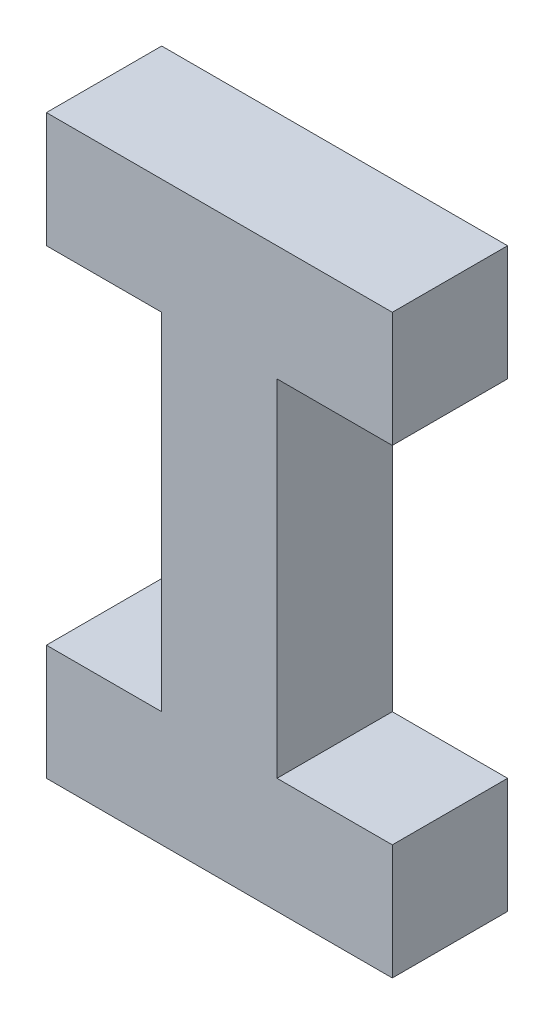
ISO-10303-21;
HEADER;
FILE_DESCRIPTION(('STEP AP214'),'2;1');
FILE_NAME('part.step','',(''),(''),'','','');
FILE_SCHEMA(('AUTOMOTIVE_DESIGN { 1 0 10303 214 1 1 1 1 }'));
ENDSEC;
DATA;
#1=APPLICATION_CONTEXT('core data for automotive mechanical design processes');
#2=APPLICATION_PROTOCOL_DEFINITION('international standard','automotive_design',2000,#1);
#3=PRODUCT_CONTEXT('',#1,'mechanical');
#4=PRODUCT('Part','Part','',(#3));
#5=PRODUCT_RELATED_PRODUCT_CATEGORY('part','',(#4));
#6=PRODUCT_DEFINITION_FORMATION('','',#4);
#7=PRODUCT_DEFINITION_CONTEXT('part definition',#1,'design');
#8=PRODUCT_DEFINITION('design','',#6,#7);
#9=PRODUCT_DEFINITION_SHAPE('','',#8);
#10=(LENGTH_UNIT() NAMED_UNIT(*) SI_UNIT(.MILLI.,.METRE.));
#11=(NAMED_UNIT(*) PLANE_ANGLE_UNIT() SI_UNIT($,.RADIAN.));
#12=(NAMED_UNIT(*) SI_UNIT($,.STERADIAN.) SOLID_ANGLE_UNIT());
#13=UNCERTAINTY_MEASURE_WITH_UNIT(LENGTH_MEASURE(1.E-05),#10,'distance_accuracy_value','');
#14=(GEOMETRIC_REPRESENTATION_CONTEXT(3) GLOBAL_UNCERTAINTY_ASSIGNED_CONTEXT((#13)) GLOBAL_UNIT_ASSIGNED_CONTEXT((#10,
#11,#12)) REPRESENTATION_CONTEXT('',''));
#15=CARTESIAN_POINT('',(0.,0.,0.));
#16=DIRECTION('',(0.,0.,1.));
#17=DIRECTION('',(1.,0.,0.));
#18=AXIS2_PLACEMENT_3D('',#15,#16,#17);
#19=CARTESIAN_POINT('',(0.,0.,10.));
#20=DIRECTION('',(1.,0.,0.));
#21=DIRECTION('',(0.,0.,-1.));
#22=AXIS2_PLACEMENT_3D('',#19,#20,#21);
#23=PLANE('',#22);
#24=DIRECTION('',(0.,-1.,0.));
#25=VECTOR('',#24,1.);
#26=CARTESIAN_POINT('',(0.,0.,0.));
#27=LINE('',#26,#25);
#28=CARTESIAN_POINT('',(0.,10.,0.));
#29=VERTEX_POINT('',#28);
#30=CARTESIAN_POINT('',(0.,0.,0.));
#31=VERTEX_POINT('',#30);
#32=EDGE_CURVE('E153',#29,#31,#27,.T.);
#33=ORIENTED_EDGE('',*,*,#32,.T.);
#34=DIRECTION('',(0.,0.,-1.));
#35=VECTOR('',#34,1.);
#36=CARTESIAN_POINT('',(0.,0.,10.));
#37=LINE('',#36,#35);
#38=CARTESIAN_POINT('',(0.,0.,10.));
#39=VERTEX_POINT('',#38);
#40=EDGE_CURVE('E11',#39,#31,#37,.T.);
#41=ORIENTED_EDGE('',*,*,#40,.F.);
#42=DIRECTION('',(0.,-1.,0.));
#43=VECTOR('',#42,1.);
#44=CARTESIAN_POINT('',(0.,0.,10.));
#45=LINE('',#44,#43);
#46=CARTESIAN_POINT('',(0.,10.,10.));
#47=VERTEX_POINT('',#46);
#48=EDGE_CURVE('E175',#47,#39,#45,.T.);
#49=ORIENTED_EDGE('',*,*,#48,.F.);
#50=DIRECTION('',(0.,0.,-1.));
#51=VECTOR('',#50,1.);
#52=CARTESIAN_POINT('',(0.,10.,10.));
#53=LINE('',#52,#51);
#54=EDGE_CURVE('E149',#47,#29,#53,.T.);
#55=ORIENTED_EDGE('',*,*,#54,.T.);
#56=EDGE_LOOP('',(#33,#41,#49,#55));
#57=FACE_BOUND('',#56,.T.);
#58=ADVANCED_FACE('F33',(#57),#23,.F.);
#59=CARTESIAN_POINT('',(0.,0.,10.));
#60=DIRECTION('',(0.,1.,0.));
#61=DIRECTION('',(0.,0.,1.));
#62=AXIS2_PLACEMENT_3D('',#59,#60,#61);
#63=PLANE('',#62);
#64=DIRECTION('',(1.,0.,0.));
#65=VECTOR('',#64,1.);
#66=CARTESIAN_POINT('',(0.,0.,0.));
#67=LINE('',#66,#65);
#68=CARTESIAN_POINT('',(30.,0.,0.));
#69=VERTEX_POINT('',#68);
#70=EDGE_CURVE('E156',#31,#69,#67,.T.);
#71=ORIENTED_EDGE('',*,*,#70,.T.);
#72=DIRECTION('',(0.,0.,-1.));
#73=VECTOR('',#72,1.);
#74=CARTESIAN_POINT('',(30.,0.,10.));
#75=LINE('',#74,#73);
#76=CARTESIAN_POINT('',(30.,0.,10.));
#77=VERTEX_POINT('',#76);
#78=EDGE_CURVE('E41',#77,#69,#75,.T.);
#79=ORIENTED_EDGE('',*,*,#78,.F.);
#80=DIRECTION('',(1.,0.,0.));
#81=VECTOR('',#80,1.);
#82=CARTESIAN_POINT('',(0.,0.,10.));
#83=LINE('',#82,#81);
#84=EDGE_CURVE('E104',#39,#77,#83,.T.);
#85=ORIENTED_EDGE('',*,*,#84,.F.);
#86=ORIENTED_EDGE('',*,*,#40,.T.);
#87=EDGE_LOOP('',(#71,#79,#85,#86));
#88=FACE_BOUND('',#87,.T.);
#89=ADVANCED_FACE('F253',(#88),#63,.F.);
#90=CARTESIAN_POINT('',(30.,0.,10.));
#91=DIRECTION('',(-1.,0.,0.));
#92=DIRECTION('',(0.,0.,1.));
#93=AXIS2_PLACEMENT_3D('',#90,#91,#92);
#94=PLANE('',#93);
#95=DIRECTION('',(0.,1.,0.));
#96=VECTOR('',#95,1.);
#97=CARTESIAN_POINT('',(30.,0.,0.));
#98=LINE('',#97,#96);
#99=CARTESIAN_POINT('',(30.,10.,0.));
#100=VERTEX_POINT('',#99);
#101=EDGE_CURVE('E158',#69,#100,#98,.T.);
#102=ORIENTED_EDGE('',*,*,#101,.T.);
#103=DIRECTION('',(0.,0.,-1.));
#104=VECTOR('',#103,1.);
#105=CARTESIAN_POINT('',(30.,10.,10.));
#106=LINE('',#105,#104);
#107=CARTESIAN_POINT('',(30.,10.,10.));
#108=VERTEX_POINT('',#107);
#109=EDGE_CURVE('E194',#108,#100,#106,.T.);
#110=ORIENTED_EDGE('',*,*,#109,.F.);
#111=DIRECTION('',(0.,1.,0.));
#112=VECTOR('',#111,1.);
#113=CARTESIAN_POINT('',(30.,0.,10.));
#114=LINE('',#113,#112);
#115=EDGE_CURVE('E202',#77,#108,#114,.T.);
#116=ORIENTED_EDGE('',*,*,#115,.F.);
#117=ORIENTED_EDGE('',*,*,#78,.T.);
#118=EDGE_LOOP('',(#102,#110,#116,#117));
#119=FACE_BOUND('',#118,.T.);
#120=ADVANCED_FACE('F200',(#119),#94,.F.);
#121=CARTESIAN_POINT('',(20.,10.,10.));
#122=DIRECTION('',(0.,-1.,0.));
#123=DIRECTION('',(0.,0.,-1.));
#124=AXIS2_PLACEMENT_3D('',#121,#122,#123);
#125=PLANE('',#124);
#126=DIRECTION('',(-1.,0.,0.));
#127=VECTOR('',#126,1.);
#128=CARTESIAN_POINT('',(20.,10.,0.));
#129=LINE('',#128,#127);
#130=CARTESIAN_POINT('',(20.,10.,0.));
#131=VERTEX_POINT('',#130);
#132=EDGE_CURVE('E160',#100,#131,#129,.T.);
#133=ORIENTED_EDGE('',*,*,#132,.T.);
#134=DIRECTION('',(0.,0.,-1.));
#135=VECTOR('',#134,1.);
#136=CARTESIAN_POINT('',(20.,10.,10.));
#137=LINE('',#136,#135);
#138=CARTESIAN_POINT('',(20.,10.,10.));
#139=VERTEX_POINT('',#138);
#140=EDGE_CURVE('E191',#139,#131,#137,.T.);
#141=ORIENTED_EDGE('',*,*,#140,.F.);
#142=DIRECTION('',(-1.,0.,0.));
#143=VECTOR('',#142,1.);
#144=CARTESIAN_POINT('',(20.,10.,10.));
#145=LINE('',#144,#143);
#146=EDGE_CURVE('E220',#108,#139,#145,.T.);
#147=ORIENTED_EDGE('',*,*,#146,.F.);
#148=ORIENTED_EDGE('',*,*,#109,.T.);
#149=EDGE_LOOP('',(#133,#141,#147,#148));
#150=FACE_BOUND('',#149,.T.);
#151=ADVANCED_FACE('F211',(#150),#125,.F.);
#152=CARTESIAN_POINT('',(20.,10.,10.));
#153=DIRECTION('',(-1.,0.,0.));
#154=DIRECTION('',(0.,0.,1.));
#155=AXIS2_PLACEMENT_3D('',#152,#153,#154);
#156=PLANE('',#155);
#157=DIRECTION('',(0.,1.,0.));
#158=VECTOR('',#157,1.);
#159=CARTESIAN_POINT('',(20.,10.,0.));
#160=LINE('',#159,#158);
#161=CARTESIAN_POINT('',(20.,40.,0.));
#162=VERTEX_POINT('',#161);
#163=EDGE_CURVE('E162',#131,#162,#160,.T.);
#164=ORIENTED_EDGE('',*,*,#163,.T.);
#165=DIRECTION('',(0.,0.,-1.));
#166=VECTOR('',#165,1.);
#167=CARTESIAN_POINT('',(20.,40.,10.));
#168=LINE('',#167,#166);
#169=CARTESIAN_POINT('',(20.,40.,10.));
#170=VERTEX_POINT('',#169);
#171=EDGE_CURVE('E188',#170,#162,#168,.T.);
#172=ORIENTED_EDGE('',*,*,#171,.F.);
#173=DIRECTION('',(0.,1.,0.));
#174=VECTOR('',#173,1.);
#175=CARTESIAN_POINT('',(20.,10.,10.));
#176=LINE('',#175,#174);
#177=EDGE_CURVE('E217',#139,#170,#176,.T.);
#178=ORIENTED_EDGE('',*,*,#177,.F.);
#179=ORIENTED_EDGE('',*,*,#140,.T.);
#180=EDGE_LOOP('',(#164,#172,#178,#179));
#181=FACE_BOUND('',#180,.T.);
#182=ADVANCED_FACE('F215',(#181),#156,.F.);
#183=CARTESIAN_POINT('',(20.,40.,10.));
#184=DIRECTION('',(0.,1.,0.));
#185=DIRECTION('',(0.,0.,1.));
#186=AXIS2_PLACEMENT_3D('',#183,#184,#185);
#187=PLANE('',#186);
#188=DIRECTION('',(1.,0.,0.));
#189=VECTOR('',#188,1.);
#190=CARTESIAN_POINT('',(20.,40.,0.));
#191=LINE('',#190,#189);
#192=CARTESIAN_POINT('',(30.,40.,0.));
#193=VERTEX_POINT('',#192);
#194=EDGE_CURVE('E164',#162,#193,#191,.T.);
#195=ORIENTED_EDGE('',*,*,#194,.T.);
#196=DIRECTION('',(0.,0.,-1.));
#197=VECTOR('',#196,1.);
#198=CARTESIAN_POINT('',(30.,40.,10.));
#199=LINE('',#198,#197);
#200=CARTESIAN_POINT('',(30.,40.,10.));
#201=VERTEX_POINT('',#200);
#202=EDGE_CURVE('E185',#201,#193,#199,.T.);
#203=ORIENTED_EDGE('',*,*,#202,.F.);
#204=DIRECTION('',(1.,0.,0.));
#205=VECTOR('',#204,1.);
#206=CARTESIAN_POINT('',(20.,40.,10.));
#207=LINE('',#206,#205);
#208=EDGE_CURVE('E219',#170,#201,#207,.T.);
#209=ORIENTED_EDGE('',*,*,#208,.F.);
#210=ORIENTED_EDGE('',*,*,#171,.T.);
#211=EDGE_LOOP('',(#195,#203,#209,#210));
#212=FACE_BOUND('',#211,.T.);
#213=ADVANCED_FACE('F266',(#212),#187,.F.);
#214=CARTESIAN_POINT('',(30.,40.,10.));
#215=DIRECTION('',(-1.,0.,0.));
#216=DIRECTION('',(0.,0.,1.));
#217=AXIS2_PLACEMENT_3D('',#214,#215,#216);
#218=PLANE('',#217);
#219=DIRECTION('',(0.,1.,0.));
#220=VECTOR('',#219,1.);
#221=CARTESIAN_POINT('',(30.,40.,0.));
#222=LINE('',#221,#220);
#223=CARTESIAN_POINT('',(30.,50.,0.));
#224=VERTEX_POINT('',#223);
#225=EDGE_CURVE('E166',#193,#224,#222,.T.);
#226=ORIENTED_EDGE('',*,*,#225,.T.);
#227=DIRECTION('',(0.,0.,-1.));
#228=VECTOR('',#227,1.);
#229=CARTESIAN_POINT('',(30.,50.,10.));
#230=LINE('',#229,#228);
#231=CARTESIAN_POINT('',(30.,50.,10.));
#232=VERTEX_POINT('',#231);
#233=EDGE_CURVE('E182',#232,#224,#230,.T.);
#234=ORIENTED_EDGE('',*,*,#233,.F.);
#235=DIRECTION('',(0.,1.,0.));
#236=VECTOR('',#235,1.);
#237=CARTESIAN_POINT('',(30.,40.,10.));
#238=LINE('',#237,#236);
#239=EDGE_CURVE('E222',#201,#232,#238,.T.);
#240=ORIENTED_EDGE('',*,*,#239,.F.);
#241=ORIENTED_EDGE('',*,*,#202,.T.);
#242=EDGE_LOOP('',(#226,#234,#240,#241));
#243=FACE_BOUND('',#242,.T.);
#244=ADVANCED_FACE('F269',(#243),#218,.F.);
#245=CARTESIAN_POINT('',(0.,50.,10.));
#246=DIRECTION('',(0.,-1.,0.));
#247=DIRECTION('',(0.,0.,-1.));
#248=AXIS2_PLACEMENT_3D('',#245,#246,#247);
#249=PLANE('',#248);
#250=DIRECTION('',(-1.,0.,0.));
#251=VECTOR('',#250,1.);
#252=CARTESIAN_POINT('',(0.,50.,0.));
#253=LINE('',#252,#251);
#254=CARTESIAN_POINT('',(0.,50.,0.));
#255=VERTEX_POINT('',#254);
#256=EDGE_CURVE('E168',#224,#255,#253,.T.);
#257=ORIENTED_EDGE('',*,*,#256,.T.);
#258=DIRECTION('',(0.,0.,-1.));
#259=VECTOR('',#258,1.);
#260=CARTESIAN_POINT('',(0.,50.,10.));
#261=LINE('',#260,#259);
#262=CARTESIAN_POINT('',(0.,50.,10.));
#263=VERTEX_POINT('',#262);
#264=EDGE_CURVE('E179',#263,#255,#261,.T.);
#265=ORIENTED_EDGE('',*,*,#264,.F.);
#266=DIRECTION('',(-1.,0.,0.));
#267=VECTOR('',#266,1.);
#268=CARTESIAN_POINT('',(0.,50.,10.));
#269=LINE('',#268,#267);
#270=EDGE_CURVE('E228',#232,#263,#269,.T.);
#271=ORIENTED_EDGE('',*,*,#270,.F.);
#272=ORIENTED_EDGE('',*,*,#233,.T.);
#273=EDGE_LOOP('',(#257,#265,#271,#272));
#274=FACE_BOUND('',#273,.T.);
#275=ADVANCED_FACE('F234',(#274),#249,.F.);
#276=CARTESIAN_POINT('',(0.,40.,10.));
#277=DIRECTION('',(1.,0.,0.));
#278=DIRECTION('',(0.,0.,-1.));
#279=AXIS2_PLACEMENT_3D('',#276,#277,#278);
#280=PLANE('',#279);
#281=DIRECTION('',(0.,-1.,0.));
#282=VECTOR('',#281,1.);
#283=CARTESIAN_POINT('',(0.,40.,0.));
#284=LINE('',#283,#282);
#285=CARTESIAN_POINT('',(0.,40.,0.));
#286=VERTEX_POINT('',#285);
#287=EDGE_CURVE('E170',#255,#286,#284,.T.);
#288=ORIENTED_EDGE('',*,*,#287,.T.);
#289=DIRECTION('',(0.,0.,-1.));
#290=VECTOR('',#289,1.);
#291=CARTESIAN_POINT('',(0.,40.,10.));
#292=LINE('',#291,#290);
#293=CARTESIAN_POINT('',(0.,40.,10.));
#294=VERTEX_POINT('',#293);
#295=EDGE_CURVE('E144',#294,#286,#292,.T.);
#296=ORIENTED_EDGE('',*,*,#295,.F.);
#297=DIRECTION('',(0.,-1.,0.));
#298=VECTOR('',#297,1.);
#299=CARTESIAN_POINT('',(0.,40.,10.));
#300=LINE('',#299,#298);
#301=EDGE_CURVE('E135',#263,#294,#300,.T.);
#302=ORIENTED_EDGE('',*,*,#301,.F.);
#303=ORIENTED_EDGE('',*,*,#264,.T.);
#304=EDGE_LOOP('',(#288,#296,#302,#303));
#305=FACE_BOUND('',#304,.T.);
#306=ADVANCED_FACE('F238',(#305),#280,.F.);
#307=CARTESIAN_POINT('',(0.,40.,10.));
#308=DIRECTION('',(0.,1.,0.));
#309=DIRECTION('',(0.,0.,1.));
#310=AXIS2_PLACEMENT_3D('',#307,#308,#309);
#311=PLANE('',#310);
#312=DIRECTION('',(1.,0.,0.));
#313=VECTOR('',#312,1.);
#314=CARTESIAN_POINT('',(0.,40.,0.));
#315=LINE('',#314,#313);
#316=CARTESIAN_POINT('',(10.,40.,0.));
#317=VERTEX_POINT('',#316);
#318=EDGE_CURVE('E143',#286,#317,#315,.T.);
#319=ORIENTED_EDGE('',*,*,#318,.T.);
#320=DIRECTION('',(0.,0.,-1.));
#321=VECTOR('',#320,1.);
#322=CARTESIAN_POINT('',(10.,40.,10.));
#323=LINE('',#322,#321);
#324=CARTESIAN_POINT('',(10.,40.,10.));
#325=VERTEX_POINT('',#324);
#326=EDGE_CURVE('E140',#325,#317,#323,.T.);
#327=ORIENTED_EDGE('',*,*,#326,.F.);
#328=DIRECTION('',(1.,0.,0.));
#329=VECTOR('',#328,1.);
#330=CARTESIAN_POINT('',(0.,40.,10.));
#331=LINE('',#330,#329);
#332=EDGE_CURVE('E129',#294,#325,#331,.T.);
#333=ORIENTED_EDGE('',*,*,#332,.F.);
#334=ORIENTED_EDGE('',*,*,#295,.T.);
#335=EDGE_LOOP('',(#319,#327,#333,#334));
#336=FACE_BOUND('',#335,.T.);
#337=ADVANCED_FACE('F141',(#336),#311,.F.);
#338=CARTESIAN_POINT('',(10.,10.,10.));
#339=DIRECTION('',(1.,0.,0.));
#340=DIRECTION('',(0.,0.,-1.));
#341=AXIS2_PLACEMENT_3D('',#338,#339,#340);
#342=PLANE('',#341);
#343=DIRECTION('',(0.,-1.,0.));
#344=VECTOR('',#343,1.);
#345=CARTESIAN_POINT('',(10.,10.,0.));
#346=LINE('',#345,#344);
#347=CARTESIAN_POINT('',(10.,10.,0.));
#348=VERTEX_POINT('',#347);
#349=EDGE_CURVE('E90',#317,#348,#346,.T.);
#350=ORIENTED_EDGE('',*,*,#349,.T.);
#351=DIRECTION('',(0.,0.,-1.));
#352=VECTOR('',#351,1.);
#353=CARTESIAN_POINT('',(10.,10.,10.));
#354=LINE('',#353,#352);
#355=CARTESIAN_POINT('',(10.,10.,10.));
#356=VERTEX_POINT('',#355);
#357=EDGE_CURVE('E145',#356,#348,#354,.T.);
#358=ORIENTED_EDGE('',*,*,#357,.F.);
#359=DIRECTION('',(0.,-1.,0.));
#360=VECTOR('',#359,1.);
#361=CARTESIAN_POINT('',(10.,10.,10.));
#362=LINE('',#361,#360);
#363=EDGE_CURVE('E133',#325,#356,#362,.T.);
#364=ORIENTED_EDGE('',*,*,#363,.F.);
#365=ORIENTED_EDGE('',*,*,#326,.T.);
#366=EDGE_LOOP('',(#350,#358,#364,#365));
#367=FACE_BOUND('',#366,.T.);
#368=ADVANCED_FACE('F147',(#367),#342,.F.);
#369=CARTESIAN_POINT('',(0.,10.,10.));
#370=DIRECTION('',(0.,-1.,0.));
#371=DIRECTION('',(0.,0.,-1.));
#372=AXIS2_PLACEMENT_3D('',#369,#370,#371);
#373=PLANE('',#372);
#374=DIRECTION('',(-1.,0.,0.));
#375=VECTOR('',#374,1.);
#376=CARTESIAN_POINT('',(0.,10.,0.));
#377=LINE('',#376,#375);
#378=EDGE_CURVE('E96',#348,#29,#377,.T.);
#379=ORIENTED_EDGE('',*,*,#378,.T.);
#380=ORIENTED_EDGE('',*,*,#54,.F.);
#381=DIRECTION('',(-1.,0.,0.));
#382=VECTOR('',#381,1.);
#383=CARTESIAN_POINT('',(0.,10.,10.));
#384=LINE('',#383,#382);
#385=EDGE_CURVE('E49',#356,#47,#384,.T.);
#386=ORIENTED_EDGE('',*,*,#385,.F.);
#387=ORIENTED_EDGE('',*,*,#357,.T.);
#388=EDGE_LOOP('',(#379,#380,#386,#387));
#389=FACE_BOUND('',#388,.T.);
#390=ADVANCED_FACE('F242',(#389),#373,.F.);
#391=CARTESIAN_POINT('',(0.,0.,10.));
#392=DIRECTION('',(0.,0.,-1.));
#393=DIRECTION('',(-1.,0.,0.));
#394=AXIS2_PLACEMENT_3D('',#391,#392,#393);
#395=PLANE('',#394);
#396=ORIENTED_EDGE('',*,*,#48,.T.);
#397=ORIENTED_EDGE('',*,*,#84,.T.);
#398=ORIENTED_EDGE('',*,*,#115,.T.);
#399=ORIENTED_EDGE('',*,*,#146,.T.);
#400=ORIENTED_EDGE('',*,*,#177,.T.);
#401=ORIENTED_EDGE('',*,*,#208,.T.);
#402=ORIENTED_EDGE('',*,*,#239,.T.);
#403=ORIENTED_EDGE('',*,*,#270,.T.);
#404=ORIENTED_EDGE('',*,*,#301,.T.);
#405=ORIENTED_EDGE('',*,*,#332,.T.);
#406=ORIENTED_EDGE('',*,*,#363,.T.);
#407=ORIENTED_EDGE('',*,*,#385,.T.);
#408=EDGE_LOOP('',(#396,#397,#398,#399,#400,#401,#402,#403,#404,#405,#406,#407));
#409=FACE_BOUND('',#408,.T.);
#410=ADVANCED_FACE('F131',(#409),#395,.F.);
#411=CARTESIAN_POINT('',(0.,0.,0.));
#412=DIRECTION('',(0.,0.,-1.));
#413=DIRECTION('',(-1.,0.,0.));
#414=AXIS2_PLACEMENT_3D('',#411,#412,#413);
#415=PLANE('',#414);
#416=ORIENTED_EDGE('',*,*,#32,.F.);
#417=ORIENTED_EDGE('',*,*,#378,.F.);
#418=ORIENTED_EDGE('',*,*,#349,.F.);
#419=ORIENTED_EDGE('',*,*,#318,.F.);
#420=ORIENTED_EDGE('',*,*,#287,.F.);
#421=ORIENTED_EDGE('',*,*,#256,.F.);
#422=ORIENTED_EDGE('',*,*,#225,.F.);
#423=ORIENTED_EDGE('',*,*,#194,.F.);
#424=ORIENTED_EDGE('',*,*,#163,.F.);
#425=ORIENTED_EDGE('',*,*,#132,.F.);
#426=ORIENTED_EDGE('',*,*,#101,.F.);
#427=ORIENTED_EDGE('',*,*,#70,.F.);
#428=EDGE_LOOP('',(#416,#417,#418,#419,#420,#421,#422,#423,#424,#425,#426,#427));
#429=FACE_BOUND('',#428,.T.);
#430=ADVANCED_FACE('F206',(#429),#415,.T.);
#431=CLOSED_SHELL('',(#58,#89,#120,#151,#182,#213,#244,#275,#306,#337,#368,#390,#410,#430));
#432=MANIFOLD_SOLID_BREP('B2',#431);
#433=ADVANCED_BREP_SHAPE_REPRESENTATION('',(#18,#432),#14);
#434=SHAPE_DEFINITION_REPRESENTATION(#9,#433);
ENDSEC;
END-ISO-10303-21;
